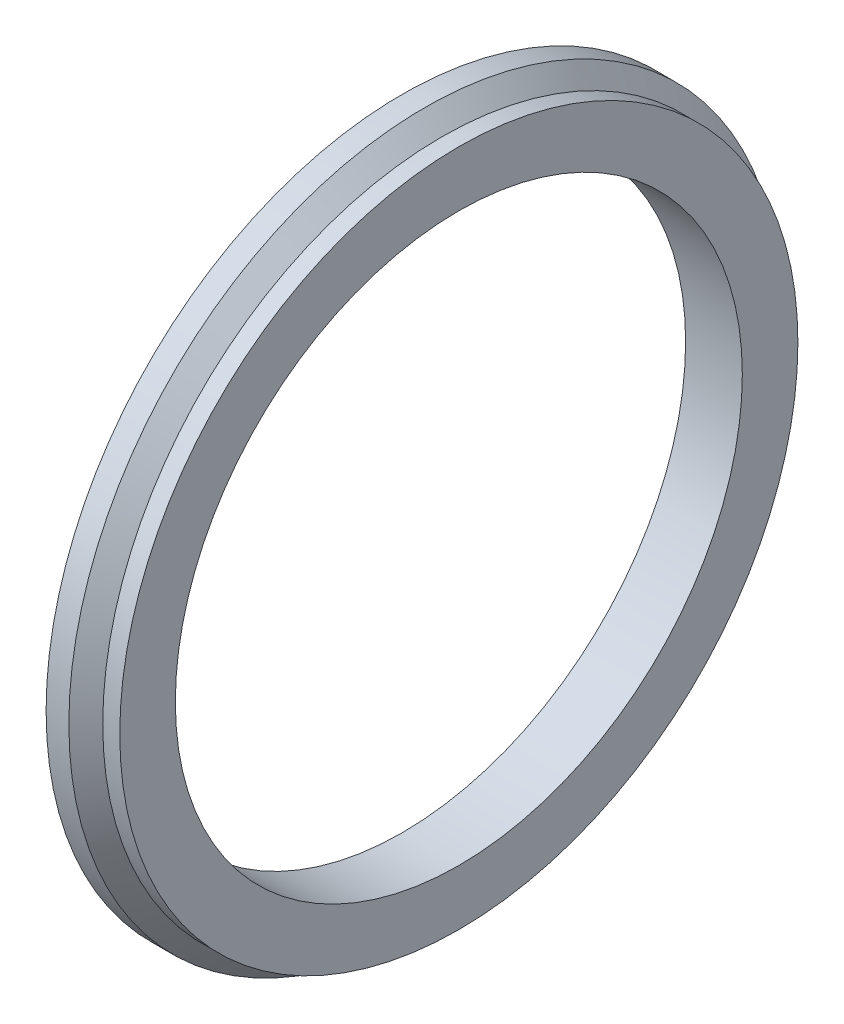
ISO-10303-21;
HEADER;
FILE_DESCRIPTION(('STEP AP214'),'2;1');
FILE_NAME('part.step','',(''),(''),'','','');
FILE_SCHEMA(('AUTOMOTIVE_DESIGN { 1 0 10303 214 1 1 1 1 }'));
ENDSEC;
DATA;
#1=APPLICATION_CONTEXT('core data for automotive mechanical design processes');
#2=APPLICATION_PROTOCOL_DEFINITION('international standard','automotive_design',2000,#1);
#3=PRODUCT_CONTEXT('',#1,'mechanical');
#4=PRODUCT('Part','Part','',(#3));
#5=PRODUCT_RELATED_PRODUCT_CATEGORY('part','',(#4));
#6=PRODUCT_DEFINITION_FORMATION('','',#4);
#7=PRODUCT_DEFINITION_CONTEXT('part definition',#1,'design');
#8=PRODUCT_DEFINITION('design','',#6,#7);
#9=PRODUCT_DEFINITION_SHAPE('','',#8);
#10=(LENGTH_UNIT() NAMED_UNIT(*) SI_UNIT(.MILLI.,.METRE.));
#11=(NAMED_UNIT(*) PLANE_ANGLE_UNIT() SI_UNIT($,.RADIAN.));
#12=(NAMED_UNIT(*) SI_UNIT($,.STERADIAN.) SOLID_ANGLE_UNIT());
#13=UNCERTAINTY_MEASURE_WITH_UNIT(LENGTH_MEASURE(1.E-05),#10,'distance_accuracy_value','');
#14=(GEOMETRIC_REPRESENTATION_CONTEXT(3) GLOBAL_UNCERTAINTY_ASSIGNED_CONTEXT((#13)) GLOBAL_UNIT_ASSIGNED_CONTEXT((#10,
#11,#12)) REPRESENTATION_CONTEXT('',''));
#15=CARTESIAN_POINT('',(0.,0.,0.));
#16=DIRECTION('',(0.,0.,1.));
#17=DIRECTION('',(1.,0.,0.));
#18=AXIS2_PLACEMENT_3D('',#15,#16,#17);
#19=CARTESIAN_POINT('',(31.25,0.,0.));
#20=DIRECTION('',(-1.,0.,0.));
#21=DIRECTION('',(0.,0.,1.));
#22=AXIS2_PLACEMENT_3D('',#19,#20,#21);
#23=CYLINDRICAL_SURFACE('',#22,29.9);
#24=CARTESIAN_POINT('',(30.5,0.,0.));
#25=DIRECTION('',(-1.,0.,0.));
#26=DIRECTION('',(0.,1.,0.));
#27=AXIS2_PLACEMENT_3D('',#24,#25,#26);
#28=CIRCLE('',#27,29.9);
#29=CARTESIAN_POINT('',(30.5,29.9,0.));
#30=VERTEX_POINT('',#29);
#31=EDGE_CURVE('E30',#30,#30,#28,.T.);
#32=ORIENTED_EDGE('',*,*,#31,.F.);
#33=EDGE_LOOP('',(#32));
#34=FACE_BOUND('',#33,.T.);
#35=CARTESIAN_POINT('',(32.,0.,0.));
#36=DIRECTION('',(-1.,0.,0.));
#37=DIRECTION('',(0.,0.,1.));
#38=AXIS2_PLACEMENT_3D('',#35,#36,#37);
#39=CIRCLE('',#38,29.9);
#40=CARTESIAN_POINT('',(32.,0.,29.9));
#41=VERTEX_POINT('',#40);
#42=EDGE_CURVE('E18',#41,#41,#39,.F.);
#43=ORIENTED_EDGE('',*,*,#42,.F.);
#44=EDGE_LOOP('',(#43));
#45=FACE_BOUND('',#44,.T.);
#46=ADVANCED_FACE('F14',(#34,#45),#23,.T.);
#47=CARTESIAN_POINT('',(32.,27.45,0.));
#48=DIRECTION('',(1.,0.,0.));
#49=DIRECTION('',(0.,0.,-1.));
#50=AXIS2_PLACEMENT_3D('',#47,#48,#49);
#51=PLANE('',#50);
#52=CARTESIAN_POINT('',(32.,0.,0.));
#53=DIRECTION('',(-1.,0.,0.));
#54=DIRECTION('',(0.,0.,1.));
#55=AXIS2_PLACEMENT_3D('',#52,#53,#54);
#56=CIRCLE('',#55,25.);
#57=CARTESIAN_POINT('',(32.,0.,25.));
#58=VERTEX_POINT('',#57);
#59=EDGE_CURVE('E32',#58,#58,#56,.F.);
#60=ORIENTED_EDGE('',*,*,#59,.F.);
#61=EDGE_LOOP('',(#60));
#62=FACE_BOUND('',#61,.T.);
#63=ORIENTED_EDGE('',*,*,#42,.T.);
#64=EDGE_LOOP('',(#63));
#65=FACE_BOUND('',#64,.T.);
#66=ADVANCED_FACE('F43',(#62,#65),#51,.T.);
#67=CARTESIAN_POINT('',(29.005,0.,0.));
#68=DIRECTION('',(-1.,0.,0.));
#69=DIRECTION('',(0.,0.,1.));
#70=AXIS2_PLACEMENT_3D('',#67,#68,#69);
#71=CONICAL_SURFACE('',#70,31.395,0.785398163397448);
#72=CARTESIAN_POINT('',(29.005,0.,0.));
#73=DIRECTION('',(-1.,0.,0.));
#74=DIRECTION('',(0.,0.,1.));
#75=AXIS2_PLACEMENT_3D('',#72,#73,#74);
#76=CIRCLE('',#75,31.395);
#77=CARTESIAN_POINT('',(29.005,0.,31.395));
#78=VERTEX_POINT('',#77);
#79=EDGE_CURVE('E27',#78,#78,#76,.T.);
#80=ORIENTED_EDGE('',*,*,#79,.F.);
#81=EDGE_LOOP('',(#80));
#82=FACE_BOUND('',#81,.T.);
#83=ORIENTED_EDGE('',*,*,#31,.T.);
#84=EDGE_LOOP('',(#83));
#85=FACE_BOUND('',#84,.T.);
#86=ADVANCED_FACE('F52',(#82,#85),#71,.T.);
#87=CARTESIAN_POINT('',(32.,0.,0.));
#88=DIRECTION('',(-1.,0.,0.));
#89=DIRECTION('',(0.,0.,1.));
#90=AXIS2_PLACEMENT_3D('',#87,#88,#89);
#91=CYLINDRICAL_SURFACE('',#90,25.);
#92=ORIENTED_EDGE('',*,*,#59,.T.);
#93=EDGE_LOOP('',(#92));
#94=FACE_BOUND('',#93,.T.);
#95=CARTESIAN_POINT('',(27.,0.,0.));
#96=DIRECTION('',(-1.,0.,0.));
#97=DIRECTION('',(0.,0.,1.));
#98=AXIS2_PLACEMENT_3D('',#95,#96,#97);
#99=CIRCLE('',#98,25.);
#100=CARTESIAN_POINT('',(27.,0.,25.));
#101=VERTEX_POINT('',#100);
#102=EDGE_CURVE('E22',#101,#101,#99,.F.);
#103=ORIENTED_EDGE('',*,*,#102,.F.);
#104=EDGE_LOOP('',(#103));
#105=FACE_BOUND('',#104,.T.);
#106=ADVANCED_FACE('F60',(#94,#105),#91,.F.);
#107=CARTESIAN_POINT('',(28.0025,0.,0.));
#108=DIRECTION('',(-1.,0.,0.));
#109=DIRECTION('',(0.,0.,1.));
#110=AXIS2_PLACEMENT_3D('',#107,#108,#109);
#111=CYLINDRICAL_SURFACE('',#110,31.395);
#112=CARTESIAN_POINT('',(27.,0.,0.));
#113=DIRECTION('',(-1.,0.,0.));
#114=DIRECTION('',(0.,0.,1.));
#115=AXIS2_PLACEMENT_3D('',#112,#113,#114);
#116=CIRCLE('',#115,31.395);
#117=CARTESIAN_POINT('',(27.,0.,31.395));
#118=VERTEX_POINT('',#117);
#119=EDGE_CURVE('E10',#118,#118,#116,.T.);
#120=ORIENTED_EDGE('',*,*,#119,.F.);
#121=EDGE_LOOP('',(#120));
#122=FACE_BOUND('',#121,.T.);
#123=ORIENTED_EDGE('',*,*,#79,.T.);
#124=EDGE_LOOP('',(#123));
#125=FACE_BOUND('',#124,.T.);
#126=ADVANCED_FACE('F56',(#122,#125),#111,.T.);
#127=CARTESIAN_POINT('',(27.,28.1975,0.));
#128=DIRECTION('',(-1.,0.,0.));
#129=DIRECTION('',(0.,0.,1.));
#130=AXIS2_PLACEMENT_3D('',#127,#128,#129);
#131=PLANE('',#130);
#132=ORIENTED_EDGE('',*,*,#119,.T.);
#133=EDGE_LOOP('',(#132));
#134=FACE_BOUND('',#133,.T.);
#135=ORIENTED_EDGE('',*,*,#102,.T.);
#136=EDGE_LOOP('',(#135));
#137=FACE_BOUND('',#136,.T.);
#138=ADVANCED_FACE('F16',(#134,#137),#131,.T.);
#139=CLOSED_SHELL('',(#46,#66,#86,#106,#126,#138));
#140=MANIFOLD_SOLID_BREP('B1',#139);
#141=ADVANCED_BREP_SHAPE_REPRESENTATION('',(#18,#140),#14);
#142=SHAPE_DEFINITION_REPRESENTATION(#9,#141);
ENDSEC;
END-ISO-10303-21;
